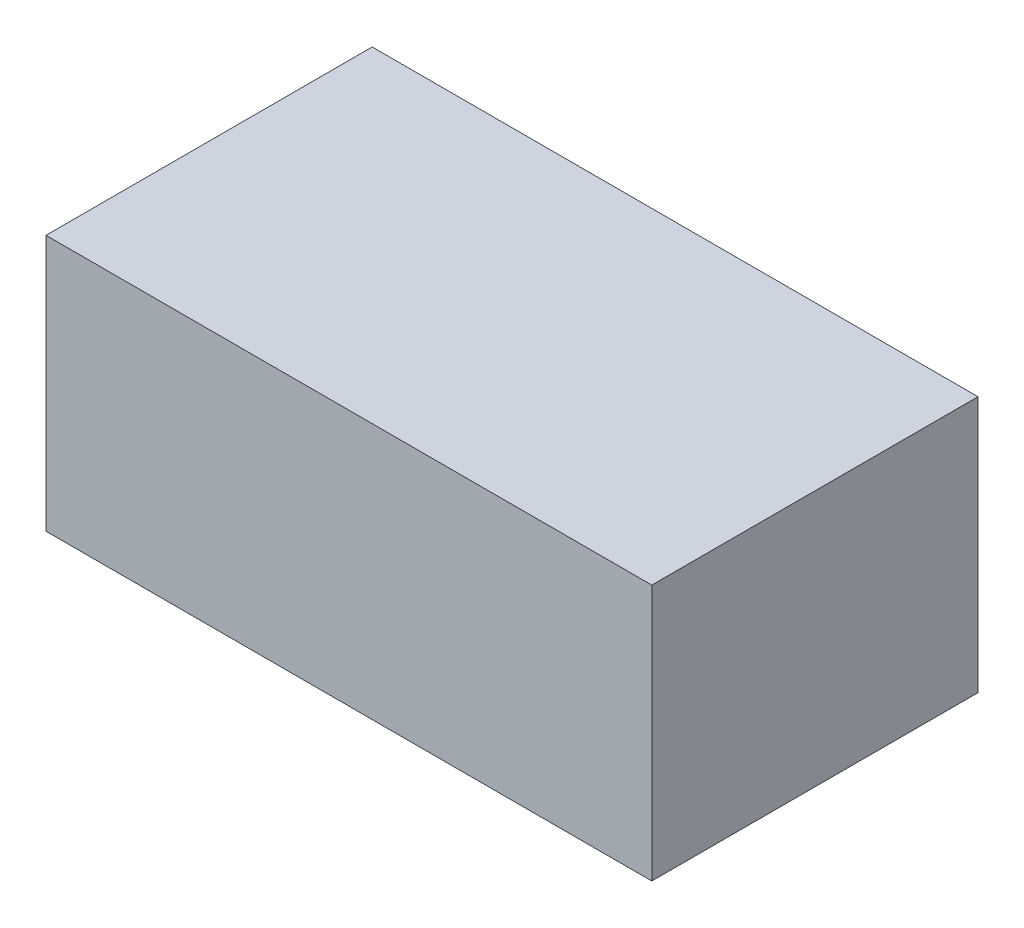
from build123d import *

# Parameters (mm, degrees)
SKETCH1_W           = 26
SKETCH1_H           = 14
BOSS_EXTRUDE1_DEPTH = 11


with BuildPart() as part:
    # Sketch1 → Boss-Extrude1 (new body)
    with BuildSketch(Plane(origin=(0, 0, 0), x_dir=(1, 0, 0), z_dir=(0, 1, 0))):
        Rectangle(SKETCH1_W, SKETCH1_H)
    extrude(amount=BOSS_EXTRUDE1_DEPTH)


solid = part.part
